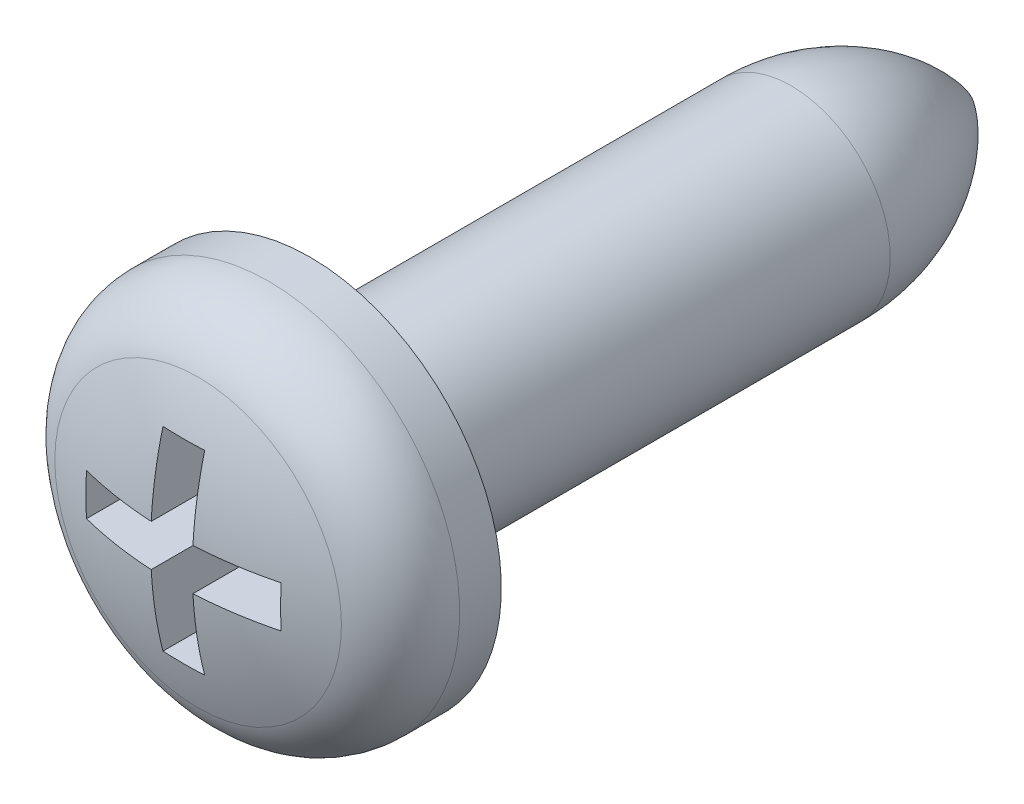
ISO-10303-21;
HEADER;
FILE_DESCRIPTION(('STEP AP214'),'2;1');
FILE_NAME('part.step','',(''),(''),'','','');
FILE_SCHEMA(('AUTOMOTIVE_DESIGN { 1 0 10303 214 1 1 1 1 }'));
ENDSEC;
DATA;
#1=APPLICATION_CONTEXT('core data for automotive mechanical design processes');
#2=APPLICATION_PROTOCOL_DEFINITION('international standard','automotive_design',2000,#1);
#3=PRODUCT_CONTEXT('',#1,'mechanical');
#4=PRODUCT('Part','Part','',(#3));
#5=PRODUCT_RELATED_PRODUCT_CATEGORY('part','',(#4));
#6=PRODUCT_DEFINITION_FORMATION('','',#4);
#7=PRODUCT_DEFINITION_CONTEXT('part definition',#1,'design');
#8=PRODUCT_DEFINITION('design','',#6,#7);
#9=PRODUCT_DEFINITION_SHAPE('','',#8);
#10=(LENGTH_UNIT() NAMED_UNIT(*) SI_UNIT(.MILLI.,.METRE.));
#11=(NAMED_UNIT(*) PLANE_ANGLE_UNIT() SI_UNIT($,.RADIAN.));
#12=(NAMED_UNIT(*) SI_UNIT($,.STERADIAN.) SOLID_ANGLE_UNIT());
#13=UNCERTAINTY_MEASURE_WITH_UNIT(LENGTH_MEASURE(1.E-05),#10,'distance_accuracy_value','');
#14=(GEOMETRIC_REPRESENTATION_CONTEXT(3) GLOBAL_UNCERTAINTY_ASSIGNED_CONTEXT((#13)) GLOBAL_UNIT_ASSIGNED_CONTEXT((#10,
#11,#12)) REPRESENTATION_CONTEXT('',''));
#15=CARTESIAN_POINT('',(0.,0.,0.));
#16=DIRECTION('',(0.,0.,1.));
#17=DIRECTION('',(1.,0.,0.));
#18=AXIS2_PLACEMENT_3D('',#15,#16,#17);
#19=CARTESIAN_POINT('',(0.,0.,23.0484059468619));
#20=DIRECTION('',(0.,0.,-1.));
#21=DIRECTION('',(0.,1.,0.));
#22=AXIS2_PLACEMENT_3D('',#19,#20,#21);
#23=CYLINDRICAL_SURFACE('',#22,1.425);
#24=CARTESIAN_POINT('',(0.,0.,21.0484059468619));
#25=DIRECTION('',(0.,0.,1.));
#26=DIRECTION('',(0.,1.,0.));
#27=AXIS2_PLACEMENT_3D('',#24,#25,#26);
#28=CIRCLE('',#27,1.425);
#29=CARTESIAN_POINT('',(0.,1.425,21.0484059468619));
#30=VERTEX_POINT('',#29);
#31=EDGE_CURVE('E71',#30,#30,#28,.T.);
#32=ORIENTED_EDGE('',*,*,#31,.F.);
#33=EDGE_LOOP('',(#32));
#34=FACE_BOUND('',#33,.T.);
#35=CARTESIAN_POINT('',(0.,0.,14.1299293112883));
#36=DIRECTION('',(0.,0.,1.));
#37=DIRECTION('',(0.,1.,0.));
#38=AXIS2_PLACEMENT_3D('',#35,#36,#37);
#39=CIRCLE('',#38,1.425);
#40=CARTESIAN_POINT('',(0.,1.425,14.1299293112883));
#41=VERTEX_POINT('',#40);
#42=EDGE_CURVE('E11',#41,#41,#39,.T.);
#43=ORIENTED_EDGE('',*,*,#42,.T.);
#44=EDGE_LOOP('',(#43));
#45=FACE_BOUND('',#44,.T.);
#46=ADVANCED_FACE('F16',(#34,#45),#23,.T.);
#47=CARTESIAN_POINT('',(0.,0.,21.6469891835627));
#48=DIRECTION('',(0.,0.,1.));
#49=DIRECTION('',(0.,1.,0.));
#50=AXIS2_PLACEMENT_3D('',#47,#48,#49);
#51=TOROIDAL_SURFACE('',#50,1.66352982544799,1.08647017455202);
#52=CARTESIAN_POINT('',(0.,0.,22.6582682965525));
#53=DIRECTION('',(0.,0.,1.));
#54=DIRECTION('',(0.,1.,0.));
#55=AXIS2_PLACEMENT_3D('',#52,#53,#54);
#56=CIRCLE('',#55,2.06068470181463);
#57=CARTESIAN_POINT('',(0.,2.06068470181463,22.6582682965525));
#58=VERTEX_POINT('',#57);
#59=EDGE_CURVE('E200',#58,#58,#56,.T.);
#60=ORIENTED_EDGE('',*,*,#59,.F.);
#61=EDGE_LOOP('',(#60));
#62=FACE_BOUND('',#61,.T.);
#63=CARTESIAN_POINT('',(0.,0.,21.6469891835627));
#64=DIRECTION('',(0.,0.,1.));
#65=DIRECTION('',(0.,1.,0.));
#66=AXIS2_PLACEMENT_3D('',#63,#64,#65);
#67=CIRCLE('',#66,2.75);
#68=CARTESIAN_POINT('',(0.,2.75,21.6469891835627));
#69=VERTEX_POINT('',#68);
#70=EDGE_CURVE('E26',#69,#69,#67,.T.);
#71=ORIENTED_EDGE('',*,*,#70,.T.);
#72=EDGE_LOOP('',(#71));
#73=FACE_BOUND('',#72,.T.);
#74=ADVANCED_FACE('F384',(#62,#73),#51,.T.);
#75=CARTESIAN_POINT('',(0.,1.425,14.1299293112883));
#76=CARTESIAN_POINT('',(-2.85,1.425,14.1299293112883));
#77=CARTESIAN_POINT('',(-2.85,-1.425,14.1299293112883));
#78=CARTESIAN_POINT('',(0.,-1.425,14.1299293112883));
#79=CARTESIAN_POINT('',(2.85,-1.425,14.1299293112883));
#80=CARTESIAN_POINT('',(2.85,1.425,14.1299293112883));
#81=CARTESIAN_POINT('',(0.,1.425,14.1299293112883));
#82=CARTESIAN_POINT('',(0.,1.425,13.0580420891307));
#83=CARTESIAN_POINT('',(-2.85,1.425,13.0580420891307));
#84=CARTESIAN_POINT('',(-2.85,-1.425,13.0580420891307));
#85=CARTESIAN_POINT('',(0.,-1.425,13.0580420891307));
#86=CARTESIAN_POINT('',(2.85,-1.425,13.0580420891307));
#87=CARTESIAN_POINT('',(2.85,1.425,13.0580420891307));
#88=CARTESIAN_POINT('',(0.,1.425,13.0580420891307));
#89=CARTESIAN_POINT('',(0.,0.906997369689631,12.1196309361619));
#90=CARTESIAN_POINT('',(-1.81399473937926,0.906997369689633,12.1196309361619));
#91=CARTESIAN_POINT('',(-1.81399473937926,-0.906997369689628,12.1196309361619));
#92=CARTESIAN_POINT('',(0.,-0.906997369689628,12.1196309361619));
#93=CARTESIAN_POINT('',(1.81399473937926,-0.906997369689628,12.1196309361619));
#94=CARTESIAN_POINT('',(1.81399473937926,0.906997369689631,12.1196309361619));
#95=CARTESIAN_POINT('',(0.,0.906997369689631,12.1196309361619));
#96=CARTESIAN_POINT('',(0.,0.,11.5484059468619));
#97=CARTESIAN_POINT('',(0.,0.,11.5484059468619));
#98=CARTESIAN_POINT('',(0.,0.,11.5484059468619));
#99=CARTESIAN_POINT('',(0.,0.,11.5484059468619));
#100=CARTESIAN_POINT('',(0.,0.,11.5484059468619));
#101=CARTESIAN_POINT('',(0.,0.,11.5484059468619));
#102=CARTESIAN_POINT('',(0.,0.,11.5484059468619));
#103=(BOUNDED_SURFACE() B_SPLINE_SURFACE(3,3,((#75,#76,#77,#78,#79,#80,#81),(#82,#83,#84,#85,
#86,#87,#88),(#89,#90,#91,#92,#93,#94,#95),(#96,#97,#98,#99,#100,#101,#102)),.UNSPECIFIED.,.F.,
.T.,.F.) B_SPLINE_SURFACE_WITH_KNOTS((4,4),(4,3,4),(0.,6.28318530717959),(-1.00875431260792,
-0.504377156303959,0.),
.UNSPECIFIED.) GEOMETRIC_REPRESENTATION_ITEM() RATIONAL_B_SPLINE_SURFACE(((1.,0.333333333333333,
0.333333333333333,1.,0.333333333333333,0.333333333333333,1.),(0.916983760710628,
0.305661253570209,0.305661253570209,0.916983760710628,0.305661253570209,0.305661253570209,
0.916983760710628),(0.916983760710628,0.305661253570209,0.305661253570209,0.916983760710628,
0.305661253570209,0.305661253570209,0.916983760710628),(1.,0.333333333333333,0.333333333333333,
1.,0.333333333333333,0.333333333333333,1.))) REPRESENTATION_ITEM('') SURFACE());
#104=CARTESIAN_POINT('',(0.,0.,11.5484059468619));
#105=VERTEX_POINT('',#104);
#106=VERTEX_LOOP('',#105);
#107=FACE_BOUND('',#106,.T.);
#108=ORIENTED_EDGE('',*,*,#42,.F.);
#109=EDGE_LOOP('',(#108));
#110=FACE_BOUND('',#109,.T.);
#111=ADVANCED_FACE('F389',(#107,#110),#103,.T.);
#112=CARTESIAN_POINT('',(0.,0.,23.0484059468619));
#113=DIRECTION('',(0.,0.,-1.));
#114=DIRECTION('',(0.,1.,0.));
#115=AXIS2_PLACEMENT_3D('',#112,#113,#114);
#116=CYLINDRICAL_SURFACE('',#115,2.75);
#117=ORIENTED_EDGE('',*,*,#70,.F.);
#118=EDGE_LOOP('',(#117));
#119=FACE_BOUND('',#118,.T.);
#120=CARTESIAN_POINT('',(0.,0.,21.0484059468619));
#121=DIRECTION('',(0.,0.,1.));
#122=DIRECTION('',(0.,1.,0.));
#123=AXIS2_PLACEMENT_3D('',#120,#121,#122);
#124=CIRCLE('',#123,2.75);
#125=CARTESIAN_POINT('',(0.,2.75,21.0484059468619));
#126=VERTEX_POINT('',#125);
#127=EDGE_CURVE('E84',#126,#126,#124,.T.);
#128=ORIENTED_EDGE('',*,*,#127,.T.);
#129=EDGE_LOOP('',(#128));
#130=FACE_BOUND('',#129,.T.);
#131=ADVANCED_FACE('F358',(#119,#130),#116,.T.);
#132=CARTESIAN_POINT('',(0.3,0.300000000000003,21.5484059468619));
#133=DIRECTION('',(0.,-1.,0.));
#134=DIRECTION('',(0.,0.,1.));
#135=AXIS2_PLACEMENT_3D('',#132,#133,#134);
#136=PLANE('',#135);
#137=CARTESIAN_POINT('',(0.,0.300000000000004,17.4111278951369));
#138=DIRECTION('',(0.,-1.,0.));
#139=DIRECTION('',(0.,0.,1.));
#140=AXIS2_PLACEMENT_3D('',#137,#138,#139);
#141=CIRCLE('',#140,5.62928981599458);
#142=CARTESIAN_POINT('',(1.4,0.3,22.8635497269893));
#143=VERTEX_POINT('',#142);
#144=CARTESIAN_POINT('',(0.3,0.3,23.0324181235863));
#145=VERTEX_POINT('',#144);
#146=EDGE_CURVE('E169',#143,#145,#141,.T.);
#147=ORIENTED_EDGE('',*,*,#146,.T.);
#148=DIRECTION('',(0.,0.,1.));
#149=VECTOR('',#148,1.);
#150=CARTESIAN_POINT('',(0.3,0.300000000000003,21.5484059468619));
#151=LINE('',#150,#149);
#152=CARTESIAN_POINT('',(0.3,0.300000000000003,21.5484059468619));
#153=VERTEX_POINT('',#152);
#154=EDGE_CURVE('E152',#153,#145,#151,.T.);
#155=ORIENTED_EDGE('',*,*,#154,.F.);
#156=DIRECTION('',(1.,0.,0.));
#157=VECTOR('',#156,1.);
#158=CARTESIAN_POINT('',(0.3,0.300000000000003,21.5484059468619));
#159=LINE('',#158,#157);
#160=CARTESIAN_POINT('',(1.4,0.3,21.5484059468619));
#161=VERTEX_POINT('',#160);
#162=EDGE_CURVE('E208',#153,#161,#159,.T.);
#163=ORIENTED_EDGE('',*,*,#162,.T.);
#164=DIRECTION('',(0.,0.,1.));
#165=VECTOR('',#164,1.);
#166=CARTESIAN_POINT('',(1.4,0.3,21.5484059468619));
#167=LINE('',#166,#165);
#168=EDGE_CURVE('E170',#161,#143,#167,.T.);
#169=ORIENTED_EDGE('',*,*,#168,.T.);
#170=EDGE_LOOP('',(#147,#155,#163,#169));
#171=FACE_BOUND('',#170,.T.);
#172=ADVANCED_FACE('F18',(#171),#136,.T.);
#173=CARTESIAN_POINT('',(1.4,0.3,21.5484059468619));
#174=DIRECTION('',(-1.,0.,0.));
#175=DIRECTION('',(0.,1.,0.));
#176=AXIS2_PLACEMENT_3D('',#173,#174,#175);
#177=PLANE('',#176);
#178=CARTESIAN_POINT('',(1.4,0.,17.4111278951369));
#179=DIRECTION('',(-1.,0.,0.));
#180=DIRECTION('',(0.,0.,1.));
#181=AXIS2_PLACEMENT_3D('',#178,#179,#180);
#182=CIRCLE('',#181,5.46066880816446);
#183=CARTESIAN_POINT('',(1.4,-0.299999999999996,22.8635497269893));
#184=VERTEX_POINT('',#183);
#185=EDGE_CURVE('E175',#184,#143,#182,.T.);
#186=ORIENTED_EDGE('',*,*,#185,.T.);
#187=ORIENTED_EDGE('',*,*,#168,.F.);
#188=DIRECTION('',(0.,-1.,0.));
#189=VECTOR('',#188,1.);
#190=CARTESIAN_POINT('',(1.4,0.3,21.5484059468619));
#191=LINE('',#190,#189);
#192=CARTESIAN_POINT('',(1.4,-0.3,21.5484059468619));
#193=VERTEX_POINT('',#192);
#194=EDGE_CURVE('E211',#161,#193,#191,.T.);
#195=ORIENTED_EDGE('',*,*,#194,.T.);
#196=DIRECTION('',(0.,0.,1.));
#197=VECTOR('',#196,1.);
#198=CARTESIAN_POINT('',(1.4,-0.3,21.5484059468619));
#199=LINE('',#198,#197);
#200=EDGE_CURVE('E192',#193,#184,#199,.T.);
#201=ORIENTED_EDGE('',*,*,#200,.T.);
#202=EDGE_LOOP('',(#186,#187,#195,#201));
#203=FACE_BOUND('',#202,.T.);
#204=ADVANCED_FACE('F337',(#203),#177,.T.);
#205=CARTESIAN_POINT('',(1.4,-0.299999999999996,21.5484059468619));
#206=DIRECTION('',(0.,1.,0.));
#207=DIRECTION('',(-1.,0.,0.));
#208=AXIS2_PLACEMENT_3D('',#205,#206,#207);
#209=PLANE('',#208);
#210=CARTESIAN_POINT('',(0.,-0.299999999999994,17.4111278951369));
#211=DIRECTION('',(0.,1.,0.));
#212=DIRECTION('',(0.,0.,-1.));
#213=AXIS2_PLACEMENT_3D('',#210,#211,#212);
#214=CIRCLE('',#213,5.62928981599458);
#215=CARTESIAN_POINT('',(0.3,-0.299999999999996,23.0324181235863));
#216=VERTEX_POINT('',#215);
#217=EDGE_CURVE('E194',#216,#184,#214,.T.);
#218=ORIENTED_EDGE('',*,*,#217,.T.);
#219=ORIENTED_EDGE('',*,*,#200,.F.);
#220=DIRECTION('',(-1.,0.,0.));
#221=VECTOR('',#220,1.);
#222=CARTESIAN_POINT('',(1.4,-0.299999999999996,21.5484059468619));
#223=LINE('',#222,#221);
#224=CARTESIAN_POINT('',(0.3,-0.299999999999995,21.5484059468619));
#225=VERTEX_POINT('',#224);
#226=EDGE_CURVE('E260',#193,#225,#223,.T.);
#227=ORIENTED_EDGE('',*,*,#226,.T.);
#228=DIRECTION('',(0.,0.,1.));
#229=VECTOR('',#228,1.);
#230=CARTESIAN_POINT('',(0.3,-0.299999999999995,21.5484059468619));
#231=LINE('',#230,#229);
#232=EDGE_CURVE('E165',#225,#216,#231,.T.);
#233=ORIENTED_EDGE('',*,*,#232,.T.);
#234=EDGE_LOOP('',(#218,#219,#227,#233));
#235=FACE_BOUND('',#234,.T.);
#236=ADVANCED_FACE('F340',(#235),#209,.T.);
#237=CARTESIAN_POINT('',(0.3,-0.299999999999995,21.5484059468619));
#238=DIRECTION('',(-1.,0.,0.));
#239=DIRECTION('',(0.,1.,0.));
#240=AXIS2_PLACEMENT_3D('',#237,#238,#239);
#241=PLANE('',#240);
#242=CARTESIAN_POINT('',(0.3,0.,17.4111278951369));
#243=DIRECTION('',(-1.,0.,0.));
#244=DIRECTION('',(0.,0.,1.));
#245=AXIS2_PLACEMENT_3D('',#242,#243,#244);
#246=CIRCLE('',#245,5.62928981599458);
#247=CARTESIAN_POINT('',(0.3,-1.4,22.8635497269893));
#248=VERTEX_POINT('',#247);
#249=EDGE_CURVE('E197',#248,#216,#246,.T.);
#250=ORIENTED_EDGE('',*,*,#249,.T.);
#251=ORIENTED_EDGE('',*,*,#232,.F.);
#252=DIRECTION('',(0.,-1.,0.));
#253=VECTOR('',#252,1.);
#254=CARTESIAN_POINT('',(0.3,-0.299999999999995,21.5484059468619));
#255=LINE('',#254,#253);
#256=CARTESIAN_POINT('',(0.3,-1.4,21.5484059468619));
#257=VERTEX_POINT('',#256);
#258=EDGE_CURVE('E228',#225,#257,#255,.T.);
#259=ORIENTED_EDGE('',*,*,#258,.T.);
#260=DIRECTION('',(0.,0.,1.));
#261=VECTOR('',#260,1.);
#262=CARTESIAN_POINT('',(0.3,-1.4,21.5484059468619));
#263=LINE('',#262,#261);
#264=EDGE_CURVE('E292',#257,#248,#263,.T.);
#265=ORIENTED_EDGE('',*,*,#264,.T.);
#266=EDGE_LOOP('',(#250,#251,#259,#265));
#267=FACE_BOUND('',#266,.T.);
#268=ADVANCED_FACE('F417',(#267),#241,.T.);
#269=CARTESIAN_POINT('',(0.3,1.4,21.5484059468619));
#270=DIRECTION('',(-1.,0.,0.));
#271=DIRECTION('',(0.,1.,0.));
#272=AXIS2_PLACEMENT_3D('',#269,#270,#271);
#273=PLANE('',#272);
#274=CARTESIAN_POINT('',(0.3,0.,17.4111278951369));
#275=DIRECTION('',(-1.,0.,0.));
#276=DIRECTION('',(0.,0.,1.));
#277=AXIS2_PLACEMENT_3D('',#274,#275,#276);
#278=CIRCLE('',#277,5.62928981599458);
#279=CARTESIAN_POINT('',(0.3,1.4,22.8635497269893));
#280=VERTEX_POINT('',#279);
#281=EDGE_CURVE('E157',#145,#280,#278,.T.);
#282=ORIENTED_EDGE('',*,*,#281,.T.);
#283=DIRECTION('',(0.,0.,1.));
#284=VECTOR('',#283,1.);
#285=CARTESIAN_POINT('',(0.3,1.4,21.5484059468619));
#286=LINE('',#285,#284);
#287=CARTESIAN_POINT('',(0.3,1.4,21.5484059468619));
#288=VERTEX_POINT('',#287);
#289=EDGE_CURVE('E166',#288,#280,#286,.T.);
#290=ORIENTED_EDGE('',*,*,#289,.F.);
#291=DIRECTION('',(0.,-1.,0.));
#292=VECTOR('',#291,1.);
#293=CARTESIAN_POINT('',(0.3,1.4,21.5484059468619));
#294=LINE('',#293,#292);
#295=EDGE_CURVE('E160',#288,#153,#294,.T.);
#296=ORIENTED_EDGE('',*,*,#295,.T.);
#297=ORIENTED_EDGE('',*,*,#154,.T.);
#298=EDGE_LOOP('',(#282,#290,#296,#297));
#299=FACE_BOUND('',#298,.T.);
#300=ADVANCED_FACE('F154',(#299),#273,.T.);
#301=CARTESIAN_POINT('',(-0.3,1.4,21.5484059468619));
#302=DIRECTION('',(0.,-1.,0.));
#303=DIRECTION('',(0.,0.,1.));
#304=AXIS2_PLACEMENT_3D('',#301,#302,#303);
#305=PLANE('',#304);
#306=CARTESIAN_POINT('',(0.,1.4,17.4111278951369));
#307=DIRECTION('',(0.,-1.,0.));
#308=DIRECTION('',(0.,0.,1.));
#309=AXIS2_PLACEMENT_3D('',#306,#307,#308);
#310=CIRCLE('',#309,5.46066880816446);
#311=CARTESIAN_POINT('',(-0.3,1.4,22.8635497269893));
#312=VERTEX_POINT('',#311);
#313=EDGE_CURVE('E181',#280,#312,#310,.T.);
#314=ORIENTED_EDGE('',*,*,#313,.T.);
#315=DIRECTION('',(0.,0.,1.));
#316=VECTOR('',#315,1.);
#317=CARTESIAN_POINT('',(-0.3,1.4,21.5484059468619));
#318=LINE('',#317,#316);
#319=CARTESIAN_POINT('',(-0.3,1.4,21.5484059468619));
#320=VERTEX_POINT('',#319);
#321=EDGE_CURVE('E289',#320,#312,#318,.T.);
#322=ORIENTED_EDGE('',*,*,#321,.F.);
#323=DIRECTION('',(1.,0.,0.));
#324=VECTOR('',#323,1.);
#325=CARTESIAN_POINT('',(-0.3,1.4,21.5484059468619));
#326=LINE('',#325,#324);
#327=EDGE_CURVE('E236',#320,#288,#326,.T.);
#328=ORIENTED_EDGE('',*,*,#327,.T.);
#329=ORIENTED_EDGE('',*,*,#289,.T.);
#330=EDGE_LOOP('',(#314,#322,#328,#329));
#331=FACE_BOUND('',#330,.T.);
#332=ADVANCED_FACE('F445',(#331),#305,.T.);
#333=CARTESIAN_POINT('',(-0.3,0.300000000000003,21.5484059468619));
#334=DIRECTION('',(1.,0.,0.));
#335=DIRECTION('',(0.,0.,-1.));
#336=AXIS2_PLACEMENT_3D('',#333,#334,#335);
#337=PLANE('',#336);
#338=CARTESIAN_POINT('',(-0.3,0.,17.4111278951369));
#339=DIRECTION('',(1.,0.,0.));
#340=DIRECTION('',(0.,0.,-1.));
#341=AXIS2_PLACEMENT_3D('',#338,#339,#340);
#342=CIRCLE('',#341,5.62928981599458);
#343=CARTESIAN_POINT('',(-0.3,0.300000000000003,23.0324181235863));
#344=VERTEX_POINT('',#343);
#345=EDGE_CURVE('E188',#312,#344,#342,.T.);
#346=ORIENTED_EDGE('',*,*,#345,.T.);
#347=DIRECTION('',(0.,0.,1.));
#348=VECTOR('',#347,1.);
#349=CARTESIAN_POINT('',(-0.3,0.300000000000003,21.5484059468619));
#350=LINE('',#349,#348);
#351=CARTESIAN_POINT('',(-0.3,0.300000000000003,21.5484059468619));
#352=VERTEX_POINT('',#351);
#353=EDGE_CURVE('E216',#352,#344,#350,.T.);
#354=ORIENTED_EDGE('',*,*,#353,.F.);
#355=DIRECTION('',(0.,1.,0.));
#356=VECTOR('',#355,1.);
#357=CARTESIAN_POINT('',(-0.3,0.300000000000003,21.5484059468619));
#358=LINE('',#357,#356);
#359=EDGE_CURVE('E240',#352,#320,#358,.T.);
#360=ORIENTED_EDGE('',*,*,#359,.T.);
#361=ORIENTED_EDGE('',*,*,#321,.T.);
#362=EDGE_LOOP('',(#346,#354,#360,#361));
#363=FACE_BOUND('',#362,.T.);
#364=ADVANCED_FACE('F408',(#363),#337,.T.);
#365=CARTESIAN_POINT('',(0.3,-1.4,21.5484059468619));
#366=DIRECTION('',(0.,1.,0.));
#367=DIRECTION('',(-1.,0.,0.));
#368=AXIS2_PLACEMENT_3D('',#365,#366,#367);
#369=PLANE('',#368);
#370=CARTESIAN_POINT('',(0.,-1.4,17.4111278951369));
#371=DIRECTION('',(0.,1.,0.));
#372=DIRECTION('',(0.,0.,-1.));
#373=AXIS2_PLACEMENT_3D('',#370,#371,#372);
#374=CIRCLE('',#373,5.46066880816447);
#375=CARTESIAN_POINT('',(-0.3,-1.4,22.8635497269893));
#376=VERTEX_POINT('',#375);
#377=EDGE_CURVE('E235',#376,#248,#374,.T.);
#378=ORIENTED_EDGE('',*,*,#377,.T.);
#379=ORIENTED_EDGE('',*,*,#264,.F.);
#380=DIRECTION('',(-1.,0.,0.));
#381=VECTOR('',#380,1.);
#382=CARTESIAN_POINT('',(0.3,-1.4,21.5484059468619));
#383=LINE('',#382,#381);
#384=CARTESIAN_POINT('',(-0.3,-1.4,21.5484059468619));
#385=VERTEX_POINT('',#384);
#386=EDGE_CURVE('E224',#257,#385,#383,.T.);
#387=ORIENTED_EDGE('',*,*,#386,.T.);
#388=DIRECTION('',(0.,0.,1.));
#389=VECTOR('',#388,1.);
#390=CARTESIAN_POINT('',(-0.3,-1.4,21.5484059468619));
#391=LINE('',#390,#389);
#392=EDGE_CURVE('E252',#385,#376,#391,.T.);
#393=ORIENTED_EDGE('',*,*,#392,.T.);
#394=EDGE_LOOP('',(#378,#379,#387,#393));
#395=FACE_BOUND('',#394,.T.);
#396=ADVANCED_FACE('F377',(#395),#369,.T.);
#397=CARTESIAN_POINT('',(-0.3,-1.4,21.5484059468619));
#398=DIRECTION('',(1.,0.,0.));
#399=DIRECTION('',(0.,0.,-1.));
#400=AXIS2_PLACEMENT_3D('',#397,#398,#399);
#401=PLANE('',#400);
#402=CARTESIAN_POINT('',(-0.3,0.,17.4111278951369));
#403=DIRECTION('',(1.,0.,0.));
#404=DIRECTION('',(0.,0.,-1.));
#405=AXIS2_PLACEMENT_3D('',#402,#403,#404);
#406=CIRCLE('',#405,5.62928981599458);
#407=CARTESIAN_POINT('',(-0.3,-0.299999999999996,23.0324181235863));
#408=VERTEX_POINT('',#407);
#409=EDGE_CURVE('E231',#408,#376,#406,.T.);
#410=ORIENTED_EDGE('',*,*,#409,.T.);
#411=ORIENTED_EDGE('',*,*,#392,.F.);
#412=DIRECTION('',(0.,1.,0.));
#413=VECTOR('',#412,1.);
#414=CARTESIAN_POINT('',(-0.3,-1.4,21.5484059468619));
#415=LINE('',#414,#413);
#416=CARTESIAN_POINT('',(-0.3,-0.299999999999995,21.5484059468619));
#417=VERTEX_POINT('',#416);
#418=EDGE_CURVE('E205',#385,#417,#415,.T.);
#419=ORIENTED_EDGE('',*,*,#418,.T.);
#420=DIRECTION('',(0.,0.,1.));
#421=VECTOR('',#420,1.);
#422=CARTESIAN_POINT('',(-0.3,-0.299999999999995,21.5484059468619));
#423=LINE('',#422,#421);
#424=EDGE_CURVE('E241',#417,#408,#423,.T.);
#425=ORIENTED_EDGE('',*,*,#424,.T.);
#426=EDGE_LOOP('',(#410,#411,#419,#425));
#427=FACE_BOUND('',#426,.T.);
#428=ADVANCED_FACE('F300',(#427),#401,.T.);
#429=CARTESIAN_POINT('',(-1.4,0.300000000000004,21.5484059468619));
#430=DIRECTION('',(0.,-1.,0.));
#431=DIRECTION('',(0.,0.,1.));
#432=AXIS2_PLACEMENT_3D('',#429,#430,#431);
#433=PLANE('',#432);
#434=CARTESIAN_POINT('',(0.,0.300000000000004,17.4111278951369));
#435=DIRECTION('',(0.,-1.,0.));
#436=DIRECTION('',(0.,0.,1.));
#437=AXIS2_PLACEMENT_3D('',#434,#435,#436);
#438=CIRCLE('',#437,5.62928981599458);
#439=CARTESIAN_POINT('',(-1.4,0.300000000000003,22.8635497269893));
#440=VERTEX_POINT('',#439);
#441=EDGE_CURVE('E222',#344,#440,#438,.T.);
#442=ORIENTED_EDGE('',*,*,#441,.T.);
#443=DIRECTION('',(0.,0.,1.));
#444=VECTOR('',#443,1.);
#445=CARTESIAN_POINT('',(-1.4,0.3,21.5484059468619));
#446=LINE('',#445,#444);
#447=CARTESIAN_POINT('',(-1.4,0.3,21.5484059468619));
#448=VERTEX_POINT('',#447);
#449=EDGE_CURVE('E212',#448,#440,#446,.T.);
#450=ORIENTED_EDGE('',*,*,#449,.F.);
#451=DIRECTION('',(1.,0.,0.));
#452=VECTOR('',#451,1.);
#453=CARTESIAN_POINT('',(-1.4,0.300000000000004,21.5484059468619));
#454=LINE('',#453,#452);
#455=EDGE_CURVE('E255',#448,#352,#454,.T.);
#456=ORIENTED_EDGE('',*,*,#455,.T.);
#457=ORIENTED_EDGE('',*,*,#353,.T.);
#458=EDGE_LOOP('',(#442,#450,#456,#457));
#459=FACE_BOUND('',#458,.T.);
#460=ADVANCED_FACE('F376',(#459),#433,.T.);
#461=CARTESIAN_POINT('',(-1.4,-0.3,21.5484059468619));
#462=DIRECTION('',(1.,0.,0.));
#463=DIRECTION('',(0.,0.,-1.));
#464=AXIS2_PLACEMENT_3D('',#461,#462,#463);
#465=PLANE('',#464);
#466=CARTESIAN_POINT('',(-1.4,0.,17.4111278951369));
#467=DIRECTION('',(1.,0.,0.));
#468=DIRECTION('',(0.,0.,-1.));
#469=AXIS2_PLACEMENT_3D('',#466,#467,#468);
#470=CIRCLE('',#469,5.46066880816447);
#471=CARTESIAN_POINT('',(-1.4,-0.3,22.8635497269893));
#472=VERTEX_POINT('',#471);
#473=EDGE_CURVE('E218',#440,#472,#470,.T.);
#474=ORIENTED_EDGE('',*,*,#473,.T.);
#475=DIRECTION('',(0.,0.,1.));
#476=VECTOR('',#475,1.);
#477=CARTESIAN_POINT('',(-1.4,-0.3,21.5484059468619));
#478=LINE('',#477,#476);
#479=CARTESIAN_POINT('',(-1.4,-0.3,21.5484059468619));
#480=VERTEX_POINT('',#479);
#481=EDGE_CURVE('E217',#480,#472,#478,.T.);
#482=ORIENTED_EDGE('',*,*,#481,.F.);
#483=DIRECTION('',(0.,1.,0.));
#484=VECTOR('',#483,1.);
#485=CARTESIAN_POINT('',(-1.4,-0.3,21.5484059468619));
#486=LINE('',#485,#484);
#487=EDGE_CURVE('E244',#480,#448,#486,.T.);
#488=ORIENTED_EDGE('',*,*,#487,.T.);
#489=ORIENTED_EDGE('',*,*,#449,.T.);
#490=EDGE_LOOP('',(#474,#482,#488,#489));
#491=FACE_BOUND('',#490,.T.);
#492=ADVANCED_FACE('F275',(#491),#465,.T.);
#493=CARTESIAN_POINT('',(-0.3,-0.299999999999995,21.5484059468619));
#494=DIRECTION('',(0.,1.,0.));
#495=DIRECTION('',(-1.,0.,0.));
#496=AXIS2_PLACEMENT_3D('',#493,#494,#495);
#497=PLANE('',#496);
#498=CARTESIAN_POINT('',(0.,-0.299999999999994,17.4111278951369));
#499=DIRECTION('',(0.,1.,0.));
#500=DIRECTION('',(0.,0.,-1.));
#501=AXIS2_PLACEMENT_3D('',#498,#499,#500);
#502=CIRCLE('',#501,5.62928981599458);
#503=EDGE_CURVE('E223',#472,#408,#502,.T.);
#504=ORIENTED_EDGE('',*,*,#503,.T.);
#505=ORIENTED_EDGE('',*,*,#424,.F.);
#506=DIRECTION('',(-1.,0.,0.));
#507=VECTOR('',#506,1.);
#508=CARTESIAN_POINT('',(-0.3,-0.299999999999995,21.5484059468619));
#509=LINE('',#508,#507);
#510=EDGE_CURVE('E201',#417,#480,#509,.T.);
#511=ORIENTED_EDGE('',*,*,#510,.T.);
#512=ORIENTED_EDGE('',*,*,#481,.T.);
#513=EDGE_LOOP('',(#504,#505,#511,#512));
#514=FACE_BOUND('',#513,.T.);
#515=ADVANCED_FACE('F269',(#514),#497,.T.);
#516=CARTESIAN_POINT('',(-1.4,-0.299999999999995,21.5484059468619));
#517=DIRECTION('',(0.,0.,-1.));
#518=DIRECTION('',(1.,0.,0.));
#519=AXIS2_PLACEMENT_3D('',#516,#517,#518);
#520=PLANE('',#519);
#521=ORIENTED_EDGE('',*,*,#510,.F.);
#522=ORIENTED_EDGE('',*,*,#418,.F.);
#523=ORIENTED_EDGE('',*,*,#386,.F.);
#524=ORIENTED_EDGE('',*,*,#258,.F.);
#525=ORIENTED_EDGE('',*,*,#226,.F.);
#526=ORIENTED_EDGE('',*,*,#194,.F.);
#527=ORIENTED_EDGE('',*,*,#162,.F.);
#528=ORIENTED_EDGE('',*,*,#295,.F.);
#529=ORIENTED_EDGE('',*,*,#327,.F.);
#530=ORIENTED_EDGE('',*,*,#359,.F.);
#531=ORIENTED_EDGE('',*,*,#455,.F.);
#532=ORIENTED_EDGE('',*,*,#487,.F.);
#533=EDGE_LOOP('',(#521,#522,#523,#524,#525,#526,#527,#528,#529,#530,#531,#532));
#534=FACE_BOUND('',#533,.T.);
#535=ADVANCED_FACE('F303',(#534),#520,.F.);
#536=CARTESIAN_POINT('',(-1.425,0.,21.0484059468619));
#537=DIRECTION('',(0.,0.,1.));
#538=DIRECTION('',(0.,1.,0.));
#539=AXIS2_PLACEMENT_3D('',#536,#537,#538);
#540=PLANE('',#539);
#541=ORIENTED_EDGE('',*,*,#31,.T.);
#542=EDGE_LOOP('',(#541));
#543=FACE_BOUND('',#542,.T.);
#544=ORIENTED_EDGE('',*,*,#127,.F.);
#545=EDGE_LOOP('',(#544));
#546=FACE_BOUND('',#545,.T.);
#547=ADVANCED_FACE('F435',(#543,#546),#540,.F.);
#548=CARTESIAN_POINT('',(0.,0.,17.4111278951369));
#549=DIRECTION('',(0.,0.,1.));
#550=DIRECTION('',(-1.,0.,0.));
#551=AXIS2_PLACEMENT_3D('',#548,#549,#550);
#552=SPHERICAL_SURFACE('',#551,5.63727805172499);
#553=ORIENTED_EDGE('',*,*,#59,.T.);
#554=EDGE_LOOP('',(#553));
#555=FACE_BOUND('',#554,.T.);
#556=ORIENTED_EDGE('',*,*,#503,.F.);
#557=ORIENTED_EDGE('',*,*,#473,.F.);
#558=ORIENTED_EDGE('',*,*,#441,.F.);
#559=ORIENTED_EDGE('',*,*,#345,.F.);
#560=ORIENTED_EDGE('',*,*,#313,.F.);
#561=ORIENTED_EDGE('',*,*,#281,.F.);
#562=ORIENTED_EDGE('',*,*,#146,.F.);
#563=ORIENTED_EDGE('',*,*,#185,.F.);
#564=ORIENTED_EDGE('',*,*,#217,.F.);
#565=ORIENTED_EDGE('',*,*,#249,.F.);
#566=ORIENTED_EDGE('',*,*,#377,.F.);
#567=ORIENTED_EDGE('',*,*,#409,.F.);
#568=EDGE_LOOP('',(#556,#557,#558,#559,#560,#561,#562,#563,#564,#565,#566,#567));
#569=FACE_BOUND('',#568,.T.);
#570=ADVANCED_FACE('F178',(#555,#569),#552,.T.);
#571=CLOSED_SHELL('',(#46,#74,#111,#131,#172,#204,#236,#268,#300,#332,#364,#396,#428,#460,#492,
#515,#535,#547,#570));
#572=MANIFOLD_SOLID_BREP('B1',#571);
#573=ADVANCED_BREP_SHAPE_REPRESENTATION('',(#18,#572),#14);
#574=SHAPE_DEFINITION_REPRESENTATION(#9,#573);
ENDSEC;
END-ISO-10303-21;
